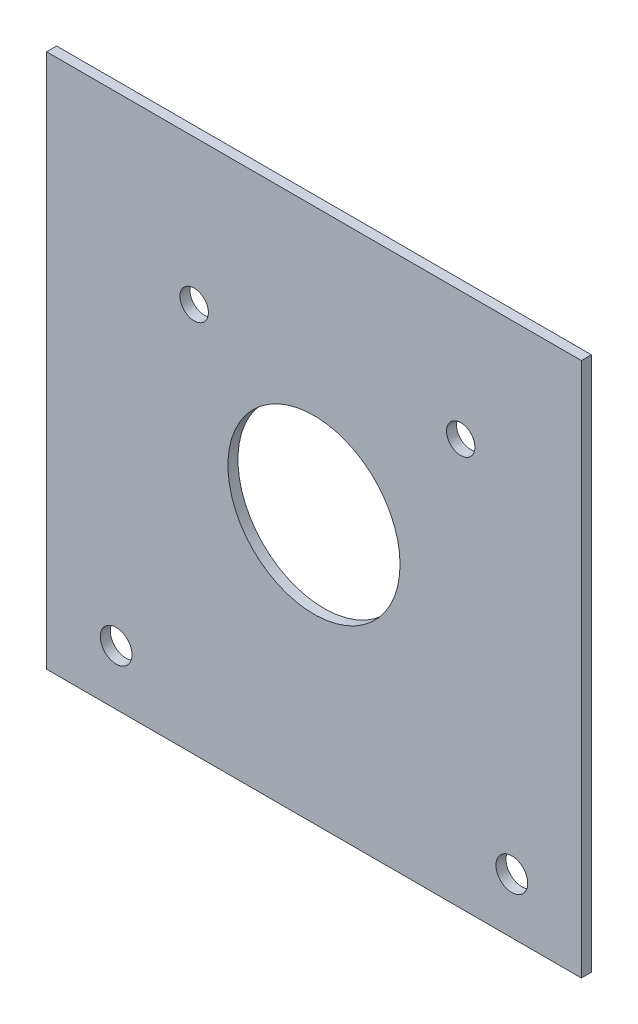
ISO-10303-21;
HEADER;
FILE_DESCRIPTION(('STEP AP214'),'2;1');
FILE_NAME('part.step','',(''),(''),'','','');
FILE_SCHEMA(('AUTOMOTIVE_DESIGN { 1 0 10303 214 1 1 1 1 }'));
ENDSEC;
DATA;
#1=APPLICATION_CONTEXT('core data for automotive mechanical design processes');
#2=APPLICATION_PROTOCOL_DEFINITION('international standard','automotive_design',2000,#1);
#3=PRODUCT_CONTEXT('',#1,'mechanical');
#4=PRODUCT('Part','Part','',(#3));
#5=PRODUCT_RELATED_PRODUCT_CATEGORY('part','',(#4));
#6=PRODUCT_DEFINITION_FORMATION('','',#4);
#7=PRODUCT_DEFINITION_CONTEXT('part definition',#1,'design');
#8=PRODUCT_DEFINITION('design','',#6,#7);
#9=PRODUCT_DEFINITION_SHAPE('','',#8);
#10=(LENGTH_UNIT() NAMED_UNIT(*) SI_UNIT(.MILLI.,.METRE.));
#11=(NAMED_UNIT(*) PLANE_ANGLE_UNIT() SI_UNIT($,.RADIAN.));
#12=(NAMED_UNIT(*) SI_UNIT($,.STERADIAN.) SOLID_ANGLE_UNIT());
#13=UNCERTAINTY_MEASURE_WITH_UNIT(LENGTH_MEASURE(1.E-05),#10,'distance_accuracy_value','');
#14=(GEOMETRIC_REPRESENTATION_CONTEXT(3) GLOBAL_UNCERTAINTY_ASSIGNED_CONTEXT((#13)) GLOBAL_UNIT_ASSIGNED_CONTEXT((#10,
#11,#12)) REPRESENTATION_CONTEXT('',''));
#15=CARTESIAN_POINT('',(0.,0.,0.));
#16=DIRECTION('',(0.,0.,1.));
#17=DIRECTION('',(1.,0.,0.));
#18=AXIS2_PLACEMENT_3D('',#15,#16,#17);
#19=CARTESIAN_POINT('',(80.,0.,3.));
#20=DIRECTION('',(1.,0.,0.));
#21=DIRECTION('',(0.,0.,-1.));
#22=AXIS2_PLACEMENT_3D('',#19,#20,#21);
#23=PLANE('',#22);
#24=DIRECTION('',(0.,-1.,0.));
#25=VECTOR('',#24,1.);
#26=CARTESIAN_POINT('',(80.,0.,0.));
#27=LINE('',#26,#25);
#28=CARTESIAN_POINT('',(80.,80.,0.));
#29=VERTEX_POINT('',#28);
#30=CARTESIAN_POINT('',(80.,-80.,0.));
#31=VERTEX_POINT('',#30);
#32=EDGE_CURVE('E116',#29,#31,#27,.T.);
#33=ORIENTED_EDGE('',*,*,#32,.F.);
#34=DIRECTION('',(0.,0.,-1.));
#35=VECTOR('',#34,1.);
#36=CARTESIAN_POINT('',(80.,80.,3.));
#37=LINE('',#36,#35);
#38=CARTESIAN_POINT('',(80.,80.,3.));
#39=VERTEX_POINT('',#38);
#40=EDGE_CURVE('E11',#39,#29,#37,.T.);
#41=ORIENTED_EDGE('',*,*,#40,.F.);
#42=DIRECTION('',(0.,-1.,0.));
#43=VECTOR('',#42,1.);
#44=CARTESIAN_POINT('',(80.,0.,3.));
#45=LINE('',#44,#43);
#46=CARTESIAN_POINT('',(80.,-80.,3.));
#47=VERTEX_POINT('',#46);
#48=EDGE_CURVE('E95',#39,#47,#45,.T.);
#49=ORIENTED_EDGE('',*,*,#48,.T.);
#50=DIRECTION('',(0.,0.,-1.));
#51=VECTOR('',#50,1.);
#52=CARTESIAN_POINT('',(80.,-80.,3.));
#53=LINE('',#52,#51);
#54=EDGE_CURVE('E75',#47,#31,#53,.T.);
#55=ORIENTED_EDGE('',*,*,#54,.T.);
#56=EDGE_LOOP('',(#33,#41,#49,#55));
#57=FACE_BOUND('',#56,.T.);
#58=ADVANCED_FACE('F37',(#57),#23,.T.);
#59=CARTESIAN_POINT('',(0.,80.,3.));
#60=DIRECTION('',(0.,1.,0.));
#61=DIRECTION('',(-1.,0.,0.));
#62=AXIS2_PLACEMENT_3D('',#59,#60,#61);
#63=PLANE('',#62);
#64=DIRECTION('',(1.,0.,0.));
#65=VECTOR('',#64,1.);
#66=CARTESIAN_POINT('',(0.,80.,0.));
#67=LINE('',#66,#65);
#68=CARTESIAN_POINT('',(-80.,80.,0.));
#69=VERTEX_POINT('',#68);
#70=EDGE_CURVE('E88',#69,#29,#67,.T.);
#71=ORIENTED_EDGE('',*,*,#70,.F.);
#72=DIRECTION('',(0.,0.,-1.));
#73=VECTOR('',#72,1.);
#74=CARTESIAN_POINT('',(-80.,80.,3.));
#75=LINE('',#74,#73);
#76=CARTESIAN_POINT('',(-80.,80.,3.));
#77=VERTEX_POINT('',#76);
#78=EDGE_CURVE('E45',#77,#69,#75,.T.);
#79=ORIENTED_EDGE('',*,*,#78,.F.);
#80=DIRECTION('',(1.,0.,0.));
#81=VECTOR('',#80,1.);
#82=CARTESIAN_POINT('',(0.,80.,3.));
#83=LINE('',#82,#81);
#84=EDGE_CURVE('E86',#77,#39,#83,.T.);
#85=ORIENTED_EDGE('',*,*,#84,.T.);
#86=ORIENTED_EDGE('',*,*,#40,.T.);
#87=EDGE_LOOP('',(#71,#79,#85,#86));
#88=FACE_BOUND('',#87,.T.);
#89=ADVANCED_FACE('F84',(#88),#63,.T.);
#90=CARTESIAN_POINT('',(-80.,0.,3.));
#91=DIRECTION('',(1.,0.,0.));
#92=DIRECTION('',(0.,0.,-1.));
#93=AXIS2_PLACEMENT_3D('',#90,#91,#92);
#94=PLANE('',#93);
#95=DIRECTION('',(0.,-1.,0.));
#96=VECTOR('',#95,1.);
#97=CARTESIAN_POINT('',(-80.,0.,0.));
#98=LINE('',#97,#96);
#99=CARTESIAN_POINT('',(-80.,-80.,0.));
#100=VERTEX_POINT('',#99);
#101=EDGE_CURVE('E68',#69,#100,#98,.T.);
#102=ORIENTED_EDGE('',*,*,#101,.T.);
#103=DIRECTION('',(0.,0.,-1.));
#104=VECTOR('',#103,1.);
#105=CARTESIAN_POINT('',(-80.,-80.,3.));
#106=LINE('',#105,#104);
#107=CARTESIAN_POINT('',(-80.,-80.,3.));
#108=VERTEX_POINT('',#107);
#109=EDGE_CURVE('E89',#108,#100,#106,.T.);
#110=ORIENTED_EDGE('',*,*,#109,.F.);
#111=DIRECTION('',(0.,-1.,0.));
#112=VECTOR('',#111,1.);
#113=CARTESIAN_POINT('',(-80.,0.,3.));
#114=LINE('',#113,#112);
#115=EDGE_CURVE('E90',#77,#108,#114,.T.);
#116=ORIENTED_EDGE('',*,*,#115,.F.);
#117=ORIENTED_EDGE('',*,*,#78,.T.);
#118=EDGE_LOOP('',(#102,#110,#116,#117));
#119=FACE_BOUND('',#118,.T.);
#120=ADVANCED_FACE('F91',(#119),#94,.F.);
#121=CARTESIAN_POINT('',(43.9,41.6,3.));
#122=DIRECTION('',(0.,0.,-1.));
#123=DIRECTION('',(-1.,0.,0.));
#124=AXIS2_PLACEMENT_3D('',#121,#122,#123);
#125=CYLINDRICAL_SURFACE('',#124,4.25000000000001);
#126=CARTESIAN_POINT('',(43.9,41.6,3.));
#127=DIRECTION('',(0.,0.,1.));
#128=DIRECTION('',(1.,0.,0.));
#129=AXIS2_PLACEMENT_3D('',#126,#127,#128);
#130=CIRCLE('',#129,4.25000000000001);
#131=CARTESIAN_POINT('',(48.15,41.6,3.));
#132=VERTEX_POINT('',#131);
#133=EDGE_CURVE('E110',#132,#132,#130,.T.);
#134=ORIENTED_EDGE('',*,*,#133,.T.);
#135=EDGE_LOOP('',(#134));
#136=FACE_BOUND('',#135,.T.);
#137=CARTESIAN_POINT('',(43.9,41.6,0.));
#138=DIRECTION('',(0.,0.,1.));
#139=DIRECTION('',(1.,0.,0.));
#140=AXIS2_PLACEMENT_3D('',#137,#138,#139);
#141=CIRCLE('',#140,4.25000000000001);
#142=CARTESIAN_POINT('',(48.15,41.6,0.));
#143=VERTEX_POINT('',#142);
#144=EDGE_CURVE('E132',#143,#143,#141,.T.);
#145=ORIENTED_EDGE('',*,*,#144,.F.);
#146=EDGE_LOOP('',(#145));
#147=FACE_BOUND('',#146,.T.);
#148=ADVANCED_FACE('F151',(#136,#147),#125,.F.);
#149=CARTESIAN_POINT('',(-35.85,36.6,3.));
#150=DIRECTION('',(0.,0.,-1.));
#151=DIRECTION('',(-1.,0.,0.));
#152=AXIS2_PLACEMENT_3D('',#149,#150,#151);
#153=CYLINDRICAL_SURFACE('',#152,4.25000000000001);
#154=CARTESIAN_POINT('',(-35.85,36.6,3.));
#155=DIRECTION('',(0.,0.,1.));
#156=DIRECTION('',(1.,0.,0.));
#157=AXIS2_PLACEMENT_3D('',#154,#155,#156);
#158=CIRCLE('',#157,4.25000000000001);
#159=CARTESIAN_POINT('',(-31.6,36.6,3.));
#160=VERTEX_POINT('',#159);
#161=EDGE_CURVE('E107',#160,#160,#158,.T.);
#162=ORIENTED_EDGE('',*,*,#161,.T.);
#163=EDGE_LOOP('',(#162));
#164=FACE_BOUND('',#163,.T.);
#165=CARTESIAN_POINT('',(-35.85,36.6,0.));
#166=DIRECTION('',(0.,0.,1.));
#167=DIRECTION('',(1.,0.,0.));
#168=AXIS2_PLACEMENT_3D('',#165,#166,#167);
#169=CIRCLE('',#168,4.25000000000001);
#170=CARTESIAN_POINT('',(-31.6,36.6,0.));
#171=VERTEX_POINT('',#170);
#172=EDGE_CURVE('E129',#171,#171,#169,.T.);
#173=ORIENTED_EDGE('',*,*,#172,.F.);
#174=EDGE_LOOP('',(#173));
#175=FACE_BOUND('',#174,.T.);
#176=ADVANCED_FACE('F164',(#164,#175),#153,.F.);
#177=CARTESIAN_POINT('',(-59.2,-63.5,3.));
#178=DIRECTION('',(0.,0.,-1.));
#179=DIRECTION('',(-1.,0.,0.));
#180=AXIS2_PLACEMENT_3D('',#177,#178,#179);
#181=CYLINDRICAL_SURFACE('',#180,4.75);
#182=CARTESIAN_POINT('',(-59.2,-63.5,3.));
#183=DIRECTION('',(0.,0.,1.));
#184=DIRECTION('',(1.,0.,0.));
#185=AXIS2_PLACEMENT_3D('',#182,#183,#184);
#186=CIRCLE('',#185,4.75);
#187=CARTESIAN_POINT('',(-54.45,-63.5,3.));
#188=VERTEX_POINT('',#187);
#189=EDGE_CURVE('E104',#188,#188,#186,.T.);
#190=ORIENTED_EDGE('',*,*,#189,.T.);
#191=EDGE_LOOP('',(#190));
#192=FACE_BOUND('',#191,.T.);
#193=CARTESIAN_POINT('',(-59.2,-63.5,0.));
#194=DIRECTION('',(0.,0.,1.));
#195=DIRECTION('',(1.,0.,0.));
#196=AXIS2_PLACEMENT_3D('',#193,#194,#195);
#197=CIRCLE('',#196,4.75);
#198=CARTESIAN_POINT('',(-54.45,-63.5,0.));
#199=VERTEX_POINT('',#198);
#200=EDGE_CURVE('E126',#199,#199,#197,.T.);
#201=ORIENTED_EDGE('',*,*,#200,.F.);
#202=EDGE_LOOP('',(#201));
#203=FACE_BOUND('',#202,.T.);
#204=ADVANCED_FACE('F160',(#192,#203),#181,.F.);
#205=CARTESIAN_POINT('',(0.,0.,3.));
#206=DIRECTION('',(0.,0.,-1.));
#207=DIRECTION('',(-1.,0.,0.));
#208=AXIS2_PLACEMENT_3D('',#205,#206,#207);
#209=CYLINDRICAL_SURFACE('',#208,25.75);
#210=CARTESIAN_POINT('',(0.,0.,3.));
#211=DIRECTION('',(0.,0.,1.));
#212=DIRECTION('',(1.,0.,0.));
#213=AXIS2_PLACEMENT_3D('',#210,#211,#212);
#214=CIRCLE('',#213,25.75);
#215=CARTESIAN_POINT('',(25.75,0.,3.));
#216=VERTEX_POINT('',#215);
#217=EDGE_CURVE('E101',#216,#216,#214,.T.);
#218=ORIENTED_EDGE('',*,*,#217,.T.);
#219=EDGE_LOOP('',(#218));
#220=FACE_BOUND('',#219,.T.);
#221=CARTESIAN_POINT('',(0.,0.,0.));
#222=DIRECTION('',(0.,0.,1.));
#223=DIRECTION('',(1.,0.,0.));
#224=AXIS2_PLACEMENT_3D('',#221,#222,#223);
#225=CIRCLE('',#224,25.75);
#226=CARTESIAN_POINT('',(25.75,0.,0.));
#227=VERTEX_POINT('',#226);
#228=EDGE_CURVE('E123',#227,#227,#225,.T.);
#229=ORIENTED_EDGE('',*,*,#228,.F.);
#230=EDGE_LOOP('',(#229));
#231=FACE_BOUND('',#230,.T.);
#232=ADVANCED_FACE('F157',(#220,#231),#209,.F.);
#233=CARTESIAN_POINT('',(0.,-80.,3.));
#234=DIRECTION('',(0.,1.,0.));
#235=DIRECTION('',(-1.,0.,0.));
#236=AXIS2_PLACEMENT_3D('',#233,#234,#235);
#237=PLANE('',#236);
#238=DIRECTION('',(1.,0.,0.));
#239=VECTOR('',#238,1.);
#240=CARTESIAN_POINT('',(0.,-80.,0.));
#241=LINE('',#240,#239);
#242=EDGE_CURVE('E121',#100,#31,#241,.T.);
#243=ORIENTED_EDGE('',*,*,#242,.T.);
#244=ORIENTED_EDGE('',*,*,#54,.F.);
#245=DIRECTION('',(1.,0.,0.));
#246=VECTOR('',#245,1.);
#247=CARTESIAN_POINT('',(0.,-80.,3.));
#248=LINE('',#247,#246);
#249=EDGE_CURVE('E53',#108,#47,#248,.T.);
#250=ORIENTED_EDGE('',*,*,#249,.F.);
#251=ORIENTED_EDGE('',*,*,#109,.T.);
#252=EDGE_LOOP('',(#243,#244,#250,#251));
#253=FACE_BOUND('',#252,.T.);
#254=ADVANCED_FACE('F140',(#253),#237,.F.);
#255=CARTESIAN_POINT('',(59.2,-63.4999999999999,3.));
#256=DIRECTION('',(0.,0.,-1.));
#257=DIRECTION('',(-1.,0.,0.));
#258=AXIS2_PLACEMENT_3D('',#255,#256,#257);
#259=CYLINDRICAL_SURFACE('',#258,4.75);
#260=CARTESIAN_POINT('',(59.2,-63.4999999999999,3.));
#261=DIRECTION('',(0.,0.,1.));
#262=DIRECTION('',(1.,0.,0.));
#263=AXIS2_PLACEMENT_3D('',#260,#261,#262);
#264=CIRCLE('',#263,4.75);
#265=CARTESIAN_POINT('',(63.95,-63.4999999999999,3.));
#266=VERTEX_POINT('',#265);
#267=EDGE_CURVE('E113',#266,#266,#264,.F.);
#268=ORIENTED_EDGE('',*,*,#267,.F.);
#269=EDGE_LOOP('',(#268));
#270=FACE_BOUND('',#269,.T.);
#271=CARTESIAN_POINT('',(59.2,-63.4999999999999,0.));
#272=DIRECTION('',(0.,0.,1.));
#273=DIRECTION('',(1.,0.,0.));
#274=AXIS2_PLACEMENT_3D('',#271,#272,#273);
#275=CIRCLE('',#274,4.75);
#276=CARTESIAN_POINT('',(63.95,-63.4999999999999,0.));
#277=VERTEX_POINT('',#276);
#278=EDGE_CURVE('E97',#277,#277,#275,.F.);
#279=ORIENTED_EDGE('',*,*,#278,.T.);
#280=EDGE_LOOP('',(#279));
#281=FACE_BOUND('',#280,.T.);
#282=ADVANCED_FACE('F156',(#270,#281),#259,.F.);
#283=CARTESIAN_POINT('',(0.,0.,3.));
#284=DIRECTION('',(0.,0.,1.));
#285=DIRECTION('',(1.,0.,0.));
#286=AXIS2_PLACEMENT_3D('',#283,#284,#285);
#287=PLANE('',#286);
#288=ORIENTED_EDGE('',*,*,#48,.F.);
#289=ORIENTED_EDGE('',*,*,#84,.F.);
#290=ORIENTED_EDGE('',*,*,#115,.T.);
#291=ORIENTED_EDGE('',*,*,#249,.T.);
#292=EDGE_LOOP('',(#288,#289,#290,#291));
#293=FACE_BOUND('',#292,.T.);
#294=ORIENTED_EDGE('',*,*,#217,.F.);
#295=EDGE_LOOP('',(#294));
#296=FACE_BOUND('',#295,.T.);
#297=ORIENTED_EDGE('',*,*,#189,.F.);
#298=EDGE_LOOP('',(#297));
#299=FACE_BOUND('',#298,.T.);
#300=ORIENTED_EDGE('',*,*,#161,.F.);
#301=EDGE_LOOP('',(#300));
#302=FACE_BOUND('',#301,.T.);
#303=ORIENTED_EDGE('',*,*,#133,.F.);
#304=EDGE_LOOP('',(#303));
#305=FACE_BOUND('',#304,.T.);
#306=ORIENTED_EDGE('',*,*,#267,.T.);
#307=EDGE_LOOP('',(#306));
#308=FACE_BOUND('',#307,.T.);
#309=ADVANCED_FACE('F93',(#293,#296,#299,#302,#305,#308),#287,.T.);
#310=CARTESIAN_POINT('',(0.,0.,0.));
#311=DIRECTION('',(0.,0.,1.));
#312=DIRECTION('',(1.,0.,0.));
#313=AXIS2_PLACEMENT_3D('',#310,#311,#312);
#314=PLANE('',#313);
#315=ORIENTED_EDGE('',*,*,#32,.T.);
#316=ORIENTED_EDGE('',*,*,#242,.F.);
#317=ORIENTED_EDGE('',*,*,#101,.F.);
#318=ORIENTED_EDGE('',*,*,#70,.T.);
#319=EDGE_LOOP('',(#315,#316,#317,#318));
#320=FACE_BOUND('',#319,.T.);
#321=ORIENTED_EDGE('',*,*,#228,.T.);
#322=EDGE_LOOP('',(#321));
#323=FACE_BOUND('',#322,.T.);
#324=ORIENTED_EDGE('',*,*,#200,.T.);
#325=EDGE_LOOP('',(#324));
#326=FACE_BOUND('',#325,.T.);
#327=ORIENTED_EDGE('',*,*,#172,.T.);
#328=EDGE_LOOP('',(#327));
#329=FACE_BOUND('',#328,.T.);
#330=ORIENTED_EDGE('',*,*,#144,.T.);
#331=EDGE_LOOP('',(#330));
#332=FACE_BOUND('',#331,.T.);
#333=ORIENTED_EDGE('',*,*,#278,.F.);
#334=EDGE_LOOP('',(#333));
#335=FACE_BOUND('',#334,.T.);
#336=ADVANCED_FACE('F142',(#320,#323,#326,#329,#332,#335),#314,.F.);
#337=CLOSED_SHELL('',(#58,#89,#120,#148,#176,#204,#232,#254,#282,#309,#336));
#338=MANIFOLD_SOLID_BREP('B2',#337);
#339=ADVANCED_BREP_SHAPE_REPRESENTATION('',(#18,#338),#14);
#340=SHAPE_DEFINITION_REPRESENTATION(#9,#339);
ENDSEC;
END-ISO-10303-21;
